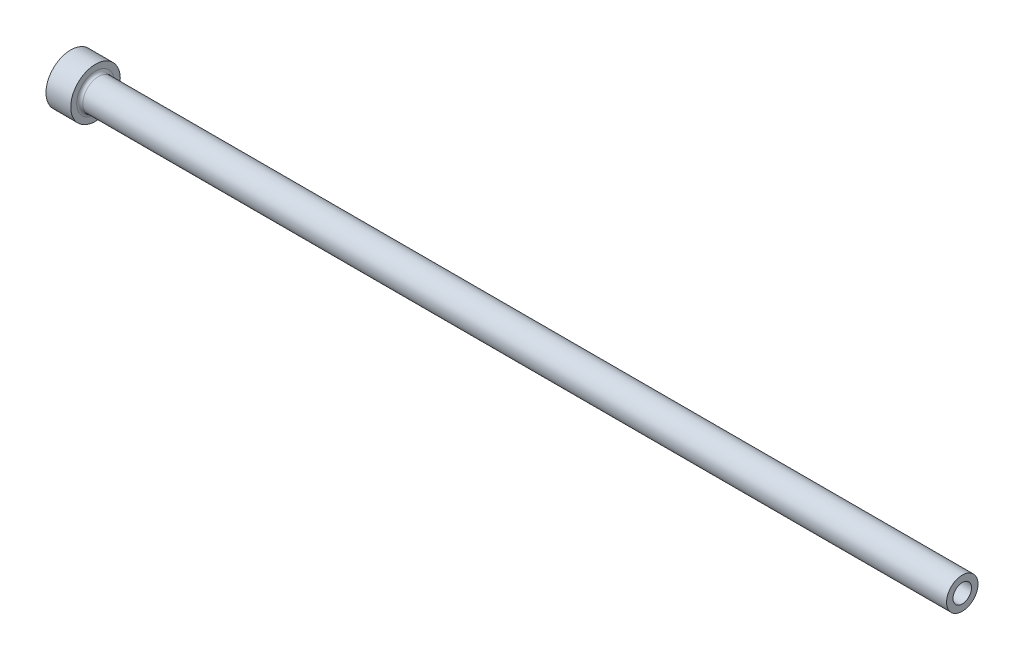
ISO-10303-21;
HEADER;
FILE_DESCRIPTION(('STEP AP214'),'2;1');
FILE_NAME('part.step','',(''),(''),'','','');
FILE_SCHEMA(('AUTOMOTIVE_DESIGN { 1 0 10303 214 1 1 1 1 }'));
ENDSEC;
DATA;
#1=APPLICATION_CONTEXT('core data for automotive mechanical design processes');
#2=APPLICATION_PROTOCOL_DEFINITION('international standard','automotive_design',2000,#1);
#3=PRODUCT_CONTEXT('',#1,'mechanical');
#4=PRODUCT('Part','Part','',(#3));
#5=PRODUCT_RELATED_PRODUCT_CATEGORY('part','',(#4));
#6=PRODUCT_DEFINITION_FORMATION('','',#4);
#7=PRODUCT_DEFINITION_CONTEXT('part definition',#1,'design');
#8=PRODUCT_DEFINITION('design','',#6,#7);
#9=PRODUCT_DEFINITION_SHAPE('','',#8);
#10=(LENGTH_UNIT() NAMED_UNIT(*) SI_UNIT(.MILLI.,.METRE.));
#11=(NAMED_UNIT(*) PLANE_ANGLE_UNIT() SI_UNIT($,.RADIAN.));
#12=(NAMED_UNIT(*) SI_UNIT($,.STERADIAN.) SOLID_ANGLE_UNIT());
#13=UNCERTAINTY_MEASURE_WITH_UNIT(LENGTH_MEASURE(1.E-05),#10,'distance_accuracy_value','');
#14=(GEOMETRIC_REPRESENTATION_CONTEXT(3) GLOBAL_UNCERTAINTY_ASSIGNED_CONTEXT((#13)) GLOBAL_UNIT_ASSIGNED_CONTEXT((#10,
#11,#12)) REPRESENTATION_CONTEXT('',''));
#15=CARTESIAN_POINT('',(0.,0.,0.));
#16=DIRECTION('',(0.,0.,1.));
#17=DIRECTION('',(1.,0.,0.));
#18=AXIS2_PLACEMENT_3D('',#15,#16,#17);
#19=CARTESIAN_POINT('',(228.599999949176,-1.18363998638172,0.));
#20=DIRECTION('',(-1.,0.,0.));
#21=DIRECTION('',(0.,-1.,0.));
#22=AXIS2_PLACEMENT_3D('',#19,#20,#21);
#23=CYLINDRICAL_SURFACE('',#22,6.35);
#24=CARTESIAN_POINT('',(-5.08240671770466E-08,-1.18363998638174,0.));
#25=DIRECTION('',(-1.,0.,0.));
#26=DIRECTION('',(0.,-1.,0.));
#27=AXIS2_PLACEMENT_3D('',#24,#25,#26);
#28=CIRCLE('',#27,6.35);
#29=CARTESIAN_POINT('',(-5.0824066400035E-08,-7.53363998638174,0.));
#30=VERTEX_POINT('',#29);
#31=EDGE_CURVE('E62',#30,#30,#28,.T.);
#32=ORIENTED_EDGE('',*,*,#31,.F.);
#33=EDGE_LOOP('',(#32));
#34=FACE_BOUND('',#33,.T.);
#35=CARTESIAN_POINT('',(6.34999994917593,-1.18363998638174,0.));
#36=DIRECTION('',(-1.,0.,0.));
#37=DIRECTION('',(0.,-1.,0.));
#38=AXIS2_PLACEMENT_3D('',#35,#36,#37);
#39=CIRCLE('',#38,6.35);
#40=CARTESIAN_POINT('',(6.34999994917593,-7.53363998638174,0.));
#41=VERTEX_POINT('',#40);
#42=EDGE_CURVE('E10',#41,#41,#39,.T.);
#43=ORIENTED_EDGE('',*,*,#42,.T.);
#44=EDGE_LOOP('',(#43));
#45=FACE_BOUND('',#44,.T.);
#46=ADVANCED_FACE('F28',(#34,#45),#23,.T.);
#47=CARTESIAN_POINT('',(6.34999994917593,3.64236001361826,0.));
#48=DIRECTION('',(-1.,0.,0.));
#49=DIRECTION('',(0.,-1.,0.));
#50=AXIS2_PLACEMENT_3D('',#47,#48,#49);
#51=PLANE('',#50);
#52=ORIENTED_EDGE('',*,*,#42,.F.);
#53=EDGE_LOOP('',(#52));
#54=FACE_BOUND('',#53,.T.);
#55=CARTESIAN_POINT('',(6.34999994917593,-1.18363998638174,0.));
#56=DIRECTION('',(-1.,0.,0.));
#57=DIRECTION('',(0.,-1.,0.));
#58=AXIS2_PLACEMENT_3D('',#55,#56,#57);
#59=CIRCLE('',#58,4.826);
#60=CARTESIAN_POINT('',(6.34999994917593,-6.00963998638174,0.));
#61=VERTEX_POINT('',#60);
#62=EDGE_CURVE('E34',#61,#61,#59,.T.);
#63=ORIENTED_EDGE('',*,*,#62,.T.);
#64=EDGE_LOOP('',(#63));
#65=FACE_BOUND('',#64,.T.);
#66=ADVANCED_FACE('F69',(#54,#65),#51,.F.);
#67=CARTESIAN_POINT('',(7.14374994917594,-1.18363998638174,0.));
#68=DIRECTION('',(-1.,0.,0.));
#69=DIRECTION('',(0.,-1.,0.));
#70=AXIS2_PLACEMENT_3D('',#67,#68,#69);
#71=TOROIDAL_SURFACE('',#70,4.826,0.793750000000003);
#72=ORIENTED_EDGE('',*,*,#62,.F.);
#73=EDGE_LOOP('',(#72));
#74=FACE_BOUND('',#73,.T.);
#75=CARTESIAN_POINT('',(7.14374994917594,-1.18363998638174,0.));
#76=DIRECTION('',(-1.,0.,0.));
#77=DIRECTION('',(0.,-1.,0.));
#78=AXIS2_PLACEMENT_3D('',#75,#76,#77);
#79=CIRCLE('',#78,4.03225);
#80=CARTESIAN_POINT('',(7.14374994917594,-5.21588998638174,0.));
#81=VERTEX_POINT('',#80);
#82=EDGE_CURVE('E38',#81,#81,#79,.T.);
#83=ORIENTED_EDGE('',*,*,#82,.T.);
#84=EDGE_LOOP('',(#83));
#85=FACE_BOUND('',#84,.T.);
#86=ADVANCED_FACE('F73',(#74,#85),#71,.F.);
#87=CARTESIAN_POINT('',(228.599999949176,-1.18363998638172,0.));
#88=DIRECTION('',(-1.,0.,0.));
#89=DIRECTION('',(0.,-1.,0.));
#90=AXIS2_PLACEMENT_3D('',#87,#88,#89);
#91=CYLINDRICAL_SURFACE('',#90,4.03225);
#92=ORIENTED_EDGE('',*,*,#82,.F.);
#93=EDGE_LOOP('',(#92));
#94=FACE_BOUND('',#93,.T.);
#95=CARTESIAN_POINT('',(228.599999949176,-1.18363998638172,0.));
#96=DIRECTION('',(-1.,0.,0.));
#97=DIRECTION('',(0.,-1.,0.));
#98=AXIS2_PLACEMENT_3D('',#95,#96,#97);
#99=CIRCLE('',#98,4.03225);
#100=CARTESIAN_POINT('',(228.599999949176,-5.21588998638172,0.));
#101=VERTEX_POINT('',#100);
#102=EDGE_CURVE('E42',#101,#101,#99,.T.);
#103=ORIENTED_EDGE('',*,*,#102,.T.);
#104=EDGE_LOOP('',(#103));
#105=FACE_BOUND('',#104,.T.);
#106=ADVANCED_FACE('F78',(#94,#105),#91,.T.);
#107=CARTESIAN_POINT('',(228.599999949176,1.19126001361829,0.));
#108=DIRECTION('',(-1.,0.,0.));
#109=DIRECTION('',(0.,-1.,0.));
#110=AXIS2_PLACEMENT_3D('',#107,#108,#109);
#111=PLANE('',#110);
#112=ORIENTED_EDGE('',*,*,#102,.F.);
#113=EDGE_LOOP('',(#112));
#114=FACE_BOUND('',#113,.T.);
#115=CARTESIAN_POINT('',(228.599999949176,-1.18363998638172,0.));
#116=DIRECTION('',(-1.,0.,0.));
#117=DIRECTION('',(0.,-1.,0.));
#118=AXIS2_PLACEMENT_3D('',#115,#116,#117);
#119=CIRCLE('',#118,2.3749);
#120=CARTESIAN_POINT('',(228.599999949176,-3.55853998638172,0.));
#121=VERTEX_POINT('',#120);
#122=EDGE_CURVE('E47',#121,#121,#119,.T.);
#123=ORIENTED_EDGE('',*,*,#122,.T.);
#124=EDGE_LOOP('',(#123));
#125=FACE_BOUND('',#124,.T.);
#126=ADVANCED_FACE('F84',(#114,#125),#111,.F.);
#127=CARTESIAN_POINT('',(228.599999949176,-1.18363998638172,0.));
#128=DIRECTION('',(-1.,0.,0.));
#129=DIRECTION('',(0.,-1.,0.));
#130=AXIS2_PLACEMENT_3D('',#127,#128,#129);
#131=CYLINDRICAL_SURFACE('',#130,2.3749);
#132=ORIENTED_EDGE('',*,*,#122,.F.);
#133=EDGE_LOOP('',(#132));
#134=FACE_BOUND('',#133,.T.);
#135=CARTESIAN_POINT('',(171.449999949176,-1.18363998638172,0.));
#136=DIRECTION('',(-1.,0.,0.));
#137=DIRECTION('',(0.,-1.,0.));
#138=AXIS2_PLACEMENT_3D('',#135,#136,#137);
#139=CIRCLE('',#138,2.37490000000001);
#140=CARTESIAN_POINT('',(171.449999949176,-3.55853998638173,0.));
#141=VERTEX_POINT('',#140);
#142=EDGE_CURVE('E50',#141,#141,#139,.T.);
#143=ORIENTED_EDGE('',*,*,#142,.T.);
#144=EDGE_LOOP('',(#143));
#145=FACE_BOUND('',#144,.T.);
#146=ADVANCED_FACE('F88',(#134,#145),#131,.F.);
#147=CARTESIAN_POINT('',(170.709421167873,-1.18363998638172,0.));
#148=DIRECTION('',(-1.,0.,0.));
#149=DIRECTION('',(0.,-1.,0.));
#150=AXIS2_PLACEMENT_3D('',#147,#148,#149);
#151=CONICAL_SURFACE('',#150,2.57333748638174,0.261799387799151);
#152=ORIENTED_EDGE('',*,*,#142,.F.);
#153=EDGE_LOOP('',(#152));
#154=FACE_BOUND('',#153,.T.);
#155=CARTESIAN_POINT('',(170.709421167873,-1.18363998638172,0.));
#156=DIRECTION('',(-1.,0.,0.));
#157=DIRECTION('',(0.,-1.,0.));
#158=AXIS2_PLACEMENT_3D('',#155,#156,#157);
#159=CIRCLE('',#158,2.57333748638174);
#160=CARTESIAN_POINT('',(170.709421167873,-3.75697747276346,0.));
#161=VERTEX_POINT('',#160);
#162=EDGE_CURVE('E53',#161,#161,#159,.T.);
#163=ORIENTED_EDGE('',*,*,#162,.T.);
#164=EDGE_LOOP('',(#163));
#165=FACE_BOUND('',#164,.T.);
#166=ADVANCED_FACE('F92',(#154,#165),#151,.F.);
#167=CARTESIAN_POINT('',(228.599999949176,-1.18363998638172,0.));
#168=DIRECTION('',(-1.,0.,0.));
#169=DIRECTION('',(0.,-1.,0.));
#170=AXIS2_PLACEMENT_3D('',#167,#168,#169);
#171=CYLINDRICAL_SURFACE('',#170,2.57333748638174);
#172=ORIENTED_EDGE('',*,*,#162,.F.);
#173=EDGE_LOOP('',(#172));
#174=FACE_BOUND('',#173,.T.);
#175=CARTESIAN_POINT('',(1.19062494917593,-1.18363998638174,0.));
#176=DIRECTION('',(-1.,0.,0.));
#177=DIRECTION('',(0.,-1.,0.));
#178=AXIS2_PLACEMENT_3D('',#175,#176,#177);
#179=CIRCLE('',#178,2.57333748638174);
#180=CARTESIAN_POINT('',(1.19062494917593,-3.75697747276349,0.));
#181=VERTEX_POINT('',#180);
#182=EDGE_CURVE('E56',#181,#181,#179,.T.);
#183=ORIENTED_EDGE('',*,*,#182,.T.);
#184=EDGE_LOOP('',(#183));
#185=FACE_BOUND('',#184,.T.);
#186=ADVANCED_FACE('F96',(#174,#185),#171,.F.);
#187=CARTESIAN_POINT('',(-5.08240671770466E-08,-1.18363998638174,0.));
#188=DIRECTION('',(-1.,0.,0.));
#189=DIRECTION('',(0.,-1.,0.));
#190=AXIS2_PLACEMENT_3D('',#187,#188,#189);
#191=CONICAL_SURFACE('',#190,3.76396250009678,0.785398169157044);
#192=ORIENTED_EDGE('',*,*,#182,.F.);
#193=EDGE_LOOP('',(#192));
#194=FACE_BOUND('',#193,.T.);
#195=CARTESIAN_POINT('',(-5.08240671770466E-08,-1.18363998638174,0.));
#196=DIRECTION('',(-1.,0.,0.));
#197=DIRECTION('',(0.,-1.,0.));
#198=AXIS2_PLACEMENT_3D('',#195,#196,#197);
#199=CIRCLE('',#198,3.76396250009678);
#200=CARTESIAN_POINT('',(-5.0824066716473E-08,-4.94760248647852,0.));
#201=VERTEX_POINT('',#200);
#202=EDGE_CURVE('E59',#201,#201,#199,.T.);
#203=ORIENTED_EDGE('',*,*,#202,.T.);
#204=EDGE_LOOP('',(#203));
#205=FACE_BOUND('',#204,.T.);
#206=ADVANCED_FACE('F100',(#194,#205),#191,.F.);
#207=CARTESIAN_POINT('',(-5.08240715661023E-08,5.16636001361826,0.));
#208=DIRECTION('',(1.,0.,0.));
#209=DIRECTION('',(0.,1.,0.));
#210=AXIS2_PLACEMENT_3D('',#207,#208,#209);
#211=PLANE('',#210);
#212=ORIENTED_EDGE('',*,*,#202,.F.);
#213=EDGE_LOOP('',(#212));
#214=FACE_BOUND('',#213,.T.);
#215=ORIENTED_EDGE('',*,*,#31,.T.);
#216=EDGE_LOOP('',(#215));
#217=FACE_BOUND('',#216,.T.);
#218=ADVANCED_FACE('F66',(#214,#217),#211,.F.);
#219=CLOSED_SHELL('',(#46,#66,#86,#106,#126,#146,#166,#186,#206,#218));
#220=MANIFOLD_SOLID_BREP('B2',#219);
#221=ADVANCED_BREP_SHAPE_REPRESENTATION('',(#18,#220),#14);
#222=SHAPE_DEFINITION_REPRESENTATION(#9,#221);
ENDSEC;
END-ISO-10303-21;
